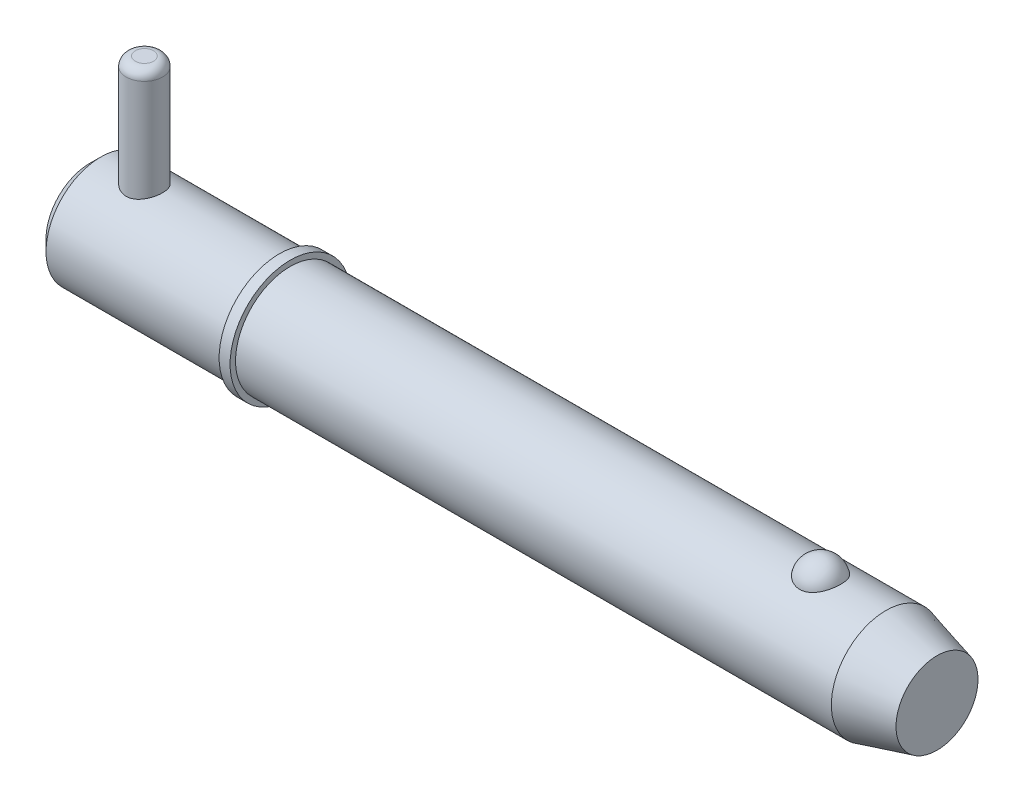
ISO-10303-21;
HEADER;
FILE_DESCRIPTION(('STEP AP214'),'2;1');
FILE_NAME('part.step','',(''),(''),'','','');
FILE_SCHEMA(('AUTOMOTIVE_DESIGN { 1 0 10303 214 1 1 1 1 }'));
ENDSEC;
DATA;
#1=APPLICATION_CONTEXT('core data for automotive mechanical design processes');
#2=APPLICATION_PROTOCOL_DEFINITION('international standard','automotive_design',2000,#1);
#3=PRODUCT_CONTEXT('',#1,'mechanical');
#4=PRODUCT('Part','Part','',(#3));
#5=PRODUCT_RELATED_PRODUCT_CATEGORY('part','',(#4));
#6=PRODUCT_DEFINITION_FORMATION('','',#4);
#7=PRODUCT_DEFINITION_CONTEXT('part definition',#1,'design');
#8=PRODUCT_DEFINITION('design','',#6,#7);
#9=PRODUCT_DEFINITION_SHAPE('','',#8);
#10=(LENGTH_UNIT() NAMED_UNIT(*) SI_UNIT(.MILLI.,.METRE.));
#11=(NAMED_UNIT(*) PLANE_ANGLE_UNIT() SI_UNIT($,.RADIAN.));
#12=(NAMED_UNIT(*) SI_UNIT($,.STERADIAN.) SOLID_ANGLE_UNIT());
#13=UNCERTAINTY_MEASURE_WITH_UNIT(LENGTH_MEASURE(1.E-05),#10,'distance_accuracy_value','');
#14=(GEOMETRIC_REPRESENTATION_CONTEXT(3) GLOBAL_UNCERTAINTY_ASSIGNED_CONTEXT((#13)) GLOBAL_UNIT_ASSIGNED_CONTEXT((#10,
#11,#12)) REPRESENTATION_CONTEXT('',''));
#15=CARTESIAN_POINT('',(0.,0.,0.));
#16=DIRECTION('',(0.,0.,1.));
#17=DIRECTION('',(1.,0.,0.));
#18=AXIS2_PLACEMENT_3D('',#15,#16,#17);
#19=CARTESIAN_POINT('',(9.52500000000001,28.575,0.));
#20=DIRECTION('',(0.,-1.,0.));
#21=DIRECTION('',(0.,0.,-1.));
#22=AXIS2_PLACEMENT_3D('',#19,#20,#21);
#23=CYLINDRICAL_SURFACE('',#22,3.175);
#24=CARTESIAN_POINT('',(9.52500000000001,-7.93750000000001,0.));
#25=DIRECTION('',(0.,1.,0.));
#26=DIRECTION('',(0.,0.,1.));
#27=AXIS2_PLACEMENT_3D('',#24,#25,#26);
#28=CIRCLE('',#27,3.175);
#29=CARTESIAN_POINT('',(9.52500000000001,-7.93750000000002,-3.175));
#30=VERTEX_POINT('',#29);
#31=EDGE_CURVE('P0_E25',#30,#30,#28,.T.);
#32=CARTESIAN_POINT('',(9.52500000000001,26.9875,0.));
#33=DIRECTION('',(0.,1.,0.));
#34=DIRECTION('',(0.,0.,1.));
#35=AXIS2_PLACEMENT_3D('',#32,#33,#34);
#36=CIRCLE('',#35,3.175);
#37=CARTESIAN_POINT('',(9.52500000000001,26.9875,-3.175));
#38=VERTEX_POINT('',#37);
#39=EDGE_CURVE('P0_E29',#38,#38,#36,.F.);
#40=CARTESIAN_POINT('',(9.52500000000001,-7.93750000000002,-3.175));
#41=CARTESIAN_POINT('',(9.52500000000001,-7.57369791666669,-3.175));
#42=CARTESIAN_POINT('',(9.52500000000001,-7.20989583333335,-3.175));
#43=CARTESIAN_POINT('',(9.52500000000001,-6.48229166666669,-3.175));
#44=CARTESIAN_POINT('',(9.52500000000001,-6.11848958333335,-3.175));
#45=CARTESIAN_POINT('',(9.52500000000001,-5.39088541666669,-3.175));
#46=CARTESIAN_POINT('',(9.52500000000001,-5.02708333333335,-3.175));
#47=CARTESIAN_POINT('',(9.52500000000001,-4.29947916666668,-3.175));
#48=CARTESIAN_POINT('',(9.52500000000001,-3.93567708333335,-3.175));
#49=CARTESIAN_POINT('',(9.52500000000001,-3.20807291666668,-3.175));
#50=CARTESIAN_POINT('',(9.52500000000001,-2.84427083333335,-3.175));
#51=CARTESIAN_POINT('',(9.52500000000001,-2.11666666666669,-3.175));
#52=CARTESIAN_POINT('',(9.52500000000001,-1.75286458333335,-3.175));
#53=CARTESIAN_POINT('',(9.52500000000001,-1.02526041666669,-3.175));
#54=CARTESIAN_POINT('',(9.52500000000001,-0.661458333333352,-3.175));
#55=CARTESIAN_POINT('',(9.52500000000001,0.0661458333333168,-3.175));
#56=CARTESIAN_POINT('',(9.52500000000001,0.429947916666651,-3.175));
#57=CARTESIAN_POINT('',(9.52500000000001,1.15755208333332,-3.175));
#58=CARTESIAN_POINT('',(9.52500000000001,1.52135416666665,-3.175));
#59=CARTESIAN_POINT('',(9.52500000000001,2.24895833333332,-3.175));
#60=CARTESIAN_POINT('',(9.52500000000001,2.61276041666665,-3.175));
#61=CARTESIAN_POINT('',(9.52500000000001,3.34036458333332,-3.175));
#62=CARTESIAN_POINT('',(9.52500000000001,3.70416666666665,-3.175));
#63=CARTESIAN_POINT('',(9.52500000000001,4.43177083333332,-3.175));
#64=CARTESIAN_POINT('',(9.52500000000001,4.79557291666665,-3.175));
#65=CARTESIAN_POINT('',(9.52500000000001,5.52317708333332,-3.175));
#66=CARTESIAN_POINT('',(9.52500000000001,5.88697916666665,-3.175));
#67=CARTESIAN_POINT('',(9.52500000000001,6.61458333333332,-3.175));
#68=CARTESIAN_POINT('',(9.52500000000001,6.97838541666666,-3.175));
#69=CARTESIAN_POINT('',(9.52500000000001,7.70598958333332,-3.175));
#70=CARTESIAN_POINT('',(9.52500000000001,8.06979166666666,-3.175));
#71=CARTESIAN_POINT('',(9.52500000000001,8.79739583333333,-3.175));
#72=CARTESIAN_POINT('',(9.52500000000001,9.16119791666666,-3.175));
#73=CARTESIAN_POINT('',(9.52500000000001,9.88880208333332,-3.175));
#74=CARTESIAN_POINT('',(9.52500000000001,10.2526041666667,-3.175));
#75=CARTESIAN_POINT('',(9.52500000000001,10.9802083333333,-3.175));
#76=CARTESIAN_POINT('',(9.52500000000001,11.3440104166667,-3.175));
#77=CARTESIAN_POINT('',(9.52500000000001,12.0716145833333,-3.175));
#78=CARTESIAN_POINT('',(9.52500000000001,12.4354166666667,-3.175));
#79=CARTESIAN_POINT('',(9.52500000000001,13.1630208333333,-3.175));
#80=CARTESIAN_POINT('',(9.52500000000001,13.5268229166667,-3.175));
#81=CARTESIAN_POINT('',(9.52500000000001,14.2544270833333,-3.175));
#82=CARTESIAN_POINT('',(9.52500000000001,14.6182291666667,-3.175));
#83=CARTESIAN_POINT('',(9.52500000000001,15.3458333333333,-3.175));
#84=CARTESIAN_POINT('',(9.52500000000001,15.7096354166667,-3.175));
#85=CARTESIAN_POINT('',(9.52500000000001,16.4372395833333,-3.175));
#86=CARTESIAN_POINT('',(9.52500000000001,16.8010416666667,-3.175));
#87=CARTESIAN_POINT('',(9.52500000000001,17.5286458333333,-3.175));
#88=CARTESIAN_POINT('',(9.52500000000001,17.8924479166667,-3.175));
#89=CARTESIAN_POINT('',(9.52500000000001,18.6200520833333,-3.175));
#90=CARTESIAN_POINT('',(9.52500000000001,18.9838541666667,-3.175));
#91=CARTESIAN_POINT('',(9.52500000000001,19.7114583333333,-3.175));
#92=CARTESIAN_POINT('',(9.52500000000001,20.0752604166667,-3.175));
#93=CARTESIAN_POINT('',(9.52500000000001,20.8028645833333,-3.175));
#94=CARTESIAN_POINT('',(9.52500000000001,21.1666666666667,-3.175));
#95=CARTESIAN_POINT('',(9.52500000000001,21.8942708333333,-3.175));
#96=CARTESIAN_POINT('',(9.52500000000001,22.2580729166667,-3.175));
#97=CARTESIAN_POINT('',(9.52500000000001,22.9856770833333,-3.175));
#98=CARTESIAN_POINT('',(9.52500000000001,23.3494791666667,-3.175));
#99=CARTESIAN_POINT('',(9.52500000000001,24.0770833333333,-3.175));
#100=CARTESIAN_POINT('',(9.52500000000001,24.4408854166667,-3.175));
#101=CARTESIAN_POINT('',(9.52500000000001,25.1684895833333,-3.175));
#102=CARTESIAN_POINT('',(9.52500000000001,25.5322916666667,-3.175));
#103=CARTESIAN_POINT('',(9.52500000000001,26.2598958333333,-3.175));
#104=CARTESIAN_POINT('',(9.52500000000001,26.6236979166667,-3.175));
#105=CARTESIAN_POINT('',(9.52500000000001,26.9875,-3.175));
#106=B_SPLINE_CURVE_WITH_KNOTS('',3,(#40,#41,#42,#43,#44,#45,#46,#47,#48,#49,#50,#51,#52,#53,
#54,#55,#56,#57,#58,#59,#60,#61,#62,#63,#64,#65,#66,#67,#68,#69,#70,#71,#72,#73,#74,#75,#76,#77,
#78,#79,#80,#81,#82,#83,#84,#85,#86,#87,#88,#89,#90,#91,#92,#93,#94,#95,#96,#97,#98,#99,#100,
#101,#102,#103,#104,#105),.UNSPECIFIED.,.F.,.F.,(4,2,2,2,2,2,2,2,2,2,2,2,2,2,2,2,2,2,2,2,2,2,2,
2,2,2,2,2,2,2,2,2,4),(0.,1.09140625,2.1828125,3.27421875,4.365625,5.45703125,6.5484375,
7.63984375,8.73125000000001,9.82265625,10.9140625,12.00546875,13.096875,14.18828125,15.2796875,
16.37109375,17.4625,18.55390625,19.6453125,20.73671875,21.828125,22.91953125,24.0109375,
25.10234375,26.19375,27.28515625,28.3765625,29.46796875,30.559375,31.65078125,32.7421875,
33.83359375,34.925),.UNSPECIFIED.);
#107=EDGE_CURVE('P0_BSEAM14',#30,#38,#106,.T.);
#108=ORIENTED_EDGE('',*,*,#31,.T.);
#109=ORIENTED_EDGE('',*,*,#39,.T.);
#110=ORIENTED_EDGE('',*,*,#107,.T.);
#111=ORIENTED_EDGE('',*,*,#107,.F.);
#112=EDGE_LOOP('',(#108,#110,#109,#111));
#113=FACE_BOUND('',#112,.T.);
#114=ADVANCED_FACE('P0_F14',(#113),#23,.T.);
#115=CARTESIAN_POINT('',(9.52500000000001,28.575,0.));
#116=DIRECTION('',(0.,1.,0.));
#117=DIRECTION('',(0.,0.,1.));
#118=AXIS2_PLACEMENT_3D('',#115,#116,#117);
#119=PLANE('',#118);
#120=CARTESIAN_POINT('',(9.52500000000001,28.575,0.));
#121=DIRECTION('',(0.,1.,0.));
#122=DIRECTION('',(0.,0.,1.));
#123=AXIS2_PLACEMENT_3D('',#120,#121,#122);
#124=CIRCLE('',#123,1.5875);
#125=CARTESIAN_POINT('',(9.52500000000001,28.575,1.5875));
#126=VERTEX_POINT('',#125);
#127=EDGE_CURVE('P0_E10',#126,#126,#124,.T.);
#128=ORIENTED_EDGE('',*,*,#127,.T.);
#129=EDGE_LOOP('',(#128));
#130=FACE_BOUND('',#129,.T.);
#131=ADVANCED_FACE('P0_F46',(#130),#119,.T.);
#132=CARTESIAN_POINT('',(9.52500000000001,-9.525,0.));
#133=DIRECTION('',(0.,1.,0.));
#134=DIRECTION('',(0.,0.,1.));
#135=AXIS2_PLACEMENT_3D('',#132,#133,#134);
#136=PLANE('',#135);
#137=CARTESIAN_POINT('',(9.52500000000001,-9.525,0.));
#138=DIRECTION('',(0.,1.,0.));
#139=DIRECTION('',(0.,0.,1.));
#140=AXIS2_PLACEMENT_3D('',#137,#138,#139);
#141=CIRCLE('',#140,1.5875);
#142=CARTESIAN_POINT('',(9.52500000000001,-9.525,1.5875));
#143=VERTEX_POINT('',#142);
#144=EDGE_CURVE('P0_E21',#143,#143,#141,.F.);
#145=ORIENTED_EDGE('',*,*,#144,.T.);
#146=EDGE_LOOP('',(#145));
#147=FACE_BOUND('',#146,.T.);
#148=ADVANCED_FACE('P0_F43',(#147),#136,.F.);
#149=CARTESIAN_POINT('',(9.52500000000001,-7.9375,0.));
#150=DIRECTION('',(0.,1.,0.));
#151=DIRECTION('',(0.,0.,1.));
#152=AXIS2_PLACEMENT_3D('',#149,#150,#151);
#153=DEGENERATE_TOROIDAL_SURFACE('',#152,1.5875,1.5875,.T.);
#154=ORIENTED_EDGE('',*,*,#144,.F.);
#155=EDGE_LOOP('',(#154));
#156=FACE_BOUND('',#155,.T.);
#157=ORIENTED_EDGE('',*,*,#31,.F.);
#158=EDGE_LOOP('',(#157));
#159=FACE_BOUND('',#158,.T.);
#160=ADVANCED_FACE('P0_F38',(#156,#159),#153,.T.);
#161=CARTESIAN_POINT('',(9.52500000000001,26.9875,0.));
#162=DIRECTION('',(0.,1.,0.));
#163=DIRECTION('',(0.,0.,1.));
#164=AXIS2_PLACEMENT_3D('',#161,#162,#163);
#165=DEGENERATE_TOROIDAL_SURFACE('',#164,1.5875,1.5875,.T.);
#166=ORIENTED_EDGE('',*,*,#39,.F.);
#167=EDGE_LOOP('',(#166));
#168=FACE_BOUND('',#167,.T.);
#169=ORIENTED_EDGE('',*,*,#127,.F.);
#170=EDGE_LOOP('',(#169));
#171=FACE_BOUND('',#170,.T.);
#172=ADVANCED_FACE('P0_F16',(#168,#171),#165,.T.);
#173=CLOSED_SHELL('',(#114,#131,#148,#160,#172));
#174=MANIFOLD_SOLID_BREP('P0_B1',#173);
#175=CARTESIAN_POINT('',(0.,0.,0.));
#176=DIRECTION('',(1.,0.,0.));
#177=DIRECTION('',(0.,0.,-1.));
#178=AXIS2_PLACEMENT_3D('',#175,#176,#177);
#179=CYLINDRICAL_SURFACE('',#178,9.525);
#180=CARTESIAN_POINT('',(138.743054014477,0.,0.));
#181=DIRECTION('',(1.,0.,0.));
#182=DIRECTION('',(0.,0.,-1.));
#183=AXIS2_PLACEMENT_3D('',#180,#181,#182);
#184=CIRCLE('',#183,9.525);
#185=CARTESIAN_POINT('',(138.743054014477,0.,-9.525));
#186=VERTEX_POINT('',#185);
#187=EDGE_CURVE('P1_E81',#186,#186,#184,.T.);
#188=ORIENTED_EDGE('',*,*,#187,.F.);
#189=EDGE_LOOP('',(#188));
#190=FACE_BOUND('',#189,.T.);
#191=CARTESIAN_POINT('',(34.93,0.,0.));
#192=DIRECTION('',(1.,0.,0.));
#193=DIRECTION('',(0.,0.,-1.));
#194=AXIS2_PLACEMENT_3D('',#191,#192,#193);
#195=CIRCLE('',#194,9.525);
#196=CARTESIAN_POINT('',(34.93,0.,-9.525));
#197=VERTEX_POINT('',#196);
#198=EDGE_CURVE('P1_E85',#197,#197,#195,.T.);
#199=ORIENTED_EDGE('',*,*,#198,.T.);
#200=EDGE_LOOP('',(#199));
#201=FACE_BOUND('',#200,.T.);
#202=CARTESIAN_POINT('',(127.345757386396,8.80405803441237,3.63513233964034));
#203=CARTESIAN_POINT('',(127.251676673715,8.80405953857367,3.63513053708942));
#204=CARTESIAN_POINT('',(127.157561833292,8.80561325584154,3.63137461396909));
#205=CARTESIAN_POINT('',(126.970012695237,8.81177748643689,3.61638665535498));
#206=CARTESIAN_POINT('',(126.876578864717,8.81638992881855,3.60514990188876));
#207=CARTESIAN_POINT('',(126.597945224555,8.8346711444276,3.56024627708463));
#208=CARTESIAN_POINT('',(126.414691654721,8.85278327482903,3.51538626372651));
#209=CARTESIAN_POINT('',(126.059509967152,8.89871214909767,3.39742145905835));
#210=CARTESIAN_POINT('',(125.887553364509,8.92650327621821,3.32439116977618));
#211=CARTESIAN_POINT('',(125.558707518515,8.98874819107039,3.15220244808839));
#212=CARTESIAN_POINT('',(125.401811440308,9.02319893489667,3.05305594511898));
#213=CARTESIAN_POINT('',(125.102214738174,9.09629186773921,2.82797815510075));
#214=CARTESIAN_POINT('',(124.960060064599,9.13502685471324,2.70135138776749));
#215=CARTESIAN_POINT('',(124.698299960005,9.2118657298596,2.42641932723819));
#216=CARTESIAN_POINT('',(124.578701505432,9.2499694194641,2.27810735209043));
#217=CARTESIAN_POINT('',(124.359645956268,9.32341082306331,1.95652290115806));
#218=CARTESIAN_POINT('',(124.261317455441,9.35855090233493,1.78243511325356));
#219=CARTESIAN_POINT('',(124.093819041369,9.42045142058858,1.41937246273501));
#220=CARTESIAN_POINT('',(124.024651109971,9.44721128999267,1.23039658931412));
#221=CARTESIAN_POINT('',(123.916199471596,9.48990641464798,0.840370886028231));
#222=CARTESIAN_POINT('',(123.877288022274,9.50570658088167,0.639202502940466));
#223=CARTESIAN_POINT('',(123.831555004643,9.52433146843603,0.232664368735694));
#224=CARTESIAN_POINT('',(123.824732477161,9.52715657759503,0.0272947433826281));
#225=CARTESIAN_POINT('',(123.843255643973,9.51956918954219,-0.380478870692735));
#226=CARTESIAN_POINT('',(123.868405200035,9.50923740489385,-0.582893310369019));
#227=CARTESIAN_POINT('',(123.95002537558,9.47651897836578,-0.980293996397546));
#228=CARTESIAN_POINT('',(124.006496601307,9.45413210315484,-1.17528009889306));
#229=CARTESIAN_POINT('',(124.149719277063,9.39954044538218,-1.55263697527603));
#230=CARTESIAN_POINT('',(124.236512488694,9.36732213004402,-1.73498993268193));
#231=CARTESIAN_POINT('',(124.438610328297,9.29640700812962,-2.08177763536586));
#232=CARTESIAN_POINT('',(124.553917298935,9.25770966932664,-2.24621090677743));
#233=CARTESIAN_POINT('',(124.811264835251,9.17775604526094,-2.55338333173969));
#234=CARTESIAN_POINT('',(124.953434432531,9.13648808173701,-2.69601150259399));
#235=CARTESIAN_POINT('',(125.26089985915,9.05620497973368,-2.95451229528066));
#236=CARTESIAN_POINT('',(125.426193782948,9.01718965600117,-3.07038711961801));
#237=CARTESIAN_POINT('',(125.772052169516,8.94680019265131,-3.26976836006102));
#238=CARTESIAN_POINT('',(125.952227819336,8.91528408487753,-3.353897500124));
#239=CARTESIAN_POINT('',(126.325651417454,8.86272514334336,-3.49043503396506));
#240=CARTESIAN_POINT('',(126.518894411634,8.84167836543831,-3.54285537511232));
#241=CARTESIAN_POINT('',(126.902503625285,8.81348056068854,-3.61241306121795));
#242=CARTESIAN_POINT('',(127.092525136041,8.80568348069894,-3.63119339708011));
#243=CARTESIAN_POINT('',(127.473190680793,8.80289410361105,-3.63795342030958));
#244=CARTESIAN_POINT('',(127.663834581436,8.80789922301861,-3.62593932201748));
#245=CARTESIAN_POINT('',(128.034007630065,8.82974915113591,-3.57238430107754));
#246=CARTESIAN_POINT('',(128.213697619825,8.84621463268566,-3.53178890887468));
#247=CARTESIAN_POINT('',(128.563422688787,8.88875330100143,-3.42331083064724));
#248=CARTESIAN_POINT('',(128.733456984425,8.91482726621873,-3.35542593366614));
#249=CARTESIAN_POINT('',(129.063237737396,8.97448239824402,-3.19248225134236));
#250=CARTESIAN_POINT('',(129.222680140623,9.00821446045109,-3.09686474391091));
#251=CARTESIAN_POINT('',(129.523513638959,9.07935398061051,-2.88162736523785));
#252=CARTESIAN_POINT('',(129.664900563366,9.11676228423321,-2.76200196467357));
#253=CARTESIAN_POINT('',(129.93331931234,9.19347419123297,-2.49516285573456));
#254=CARTESIAN_POINT('',(130.059275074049,9.23277872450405,-2.34686614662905));
#255=CARTESIAN_POINT('',(130.285522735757,9.3073761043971,-2.0309368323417));
#256=CARTESIAN_POINT('',(130.38581004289,9.34266823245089,-1.86330077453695));
#257=CARTESIAN_POINT('',(130.561514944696,9.40674710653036,-1.50744893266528));
#258=CARTESIAN_POINT('',(130.636041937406,9.43529176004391,-1.31874876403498));
#259=CARTESIAN_POINT('',(130.75416505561,9.48144132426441,-0.93063102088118));
#260=CARTESIAN_POINT('',(130.797760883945,9.49904612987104,-0.731213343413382));
#261=CARTESIAN_POINT('',(130.853158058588,9.5215314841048,-0.32714729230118));
#262=CARTESIAN_POINT('',(130.864935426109,9.52640243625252,-0.122495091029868));
#263=CARTESIAN_POINT('',(130.856382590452,9.5228957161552,0.286018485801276));
#264=CARTESIAN_POINT('',(130.83605305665,9.5145183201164,0.489879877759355));
#265=CARTESIAN_POINT('',(130.763884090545,9.48544083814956,0.889994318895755));
#266=CARTESIAN_POINT('',(130.712199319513,9.46480124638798,1.08627971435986));
#267=CARTESIAN_POINT('',(130.578491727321,9.4133389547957,1.46682086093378));
#268=CARTESIAN_POINT('',(130.496466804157,9.38251554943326,1.65107577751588));
#269=CARTESIAN_POINT('',(130.30319292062,9.31365636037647,2.00346348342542));
#270=CARTESIAN_POINT('',(130.191783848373,9.27558138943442,2.17150083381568));
#271=CARTESIAN_POINT('',(129.942294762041,9.19638714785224,2.48563115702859));
#272=CARTESIAN_POINT('',(129.804216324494,9.15526805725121,2.63172542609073));
#273=CARTESIAN_POINT('',(129.504843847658,9.07465393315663,2.89750997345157));
#274=CARTESIAN_POINT('',(129.343610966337,9.03515496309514,3.01726776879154));
#275=CARTESIAN_POINT('',(129.001613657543,8.96227564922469,3.22732920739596));
#276=CARTESIAN_POINT('',(128.820841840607,8.92889763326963,3.31762165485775));
#277=CARTESIAN_POINT('',(128.451445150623,8.8734538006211,3.46314419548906));
#278=CARTESIAN_POINT('',(128.26332371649,8.85102983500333,3.51950082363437));
#279=CARTESIAN_POINT('',(127.97578699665,8.8266696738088,3.57993683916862));
#280=CARTESIAN_POINT('',(127.879133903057,8.82009725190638,3.59606217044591));
#281=CARTESIAN_POINT('',(127.684677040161,8.81020897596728,3.62022512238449));
#282=CARTESIAN_POINT('',(127.58687410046,8.80689090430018,3.62826825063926));
#283=CARTESIAN_POINT('',(127.441224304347,8.80445615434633,3.63416760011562));
#284=CARTESIAN_POINT('',(127.393495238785,8.80405727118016,3.63513325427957));
#285=CARTESIAN_POINT('',(127.345757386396,8.80405803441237,3.63513233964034));
#286=B_SPLINE_CURVE_WITH_KNOTS('',3,(#202,#203,#204,#205,#206,#207,#208,#209,#210,#211,#212,
#213,#214,#215,#216,#217,#218,#219,#220,#221,#222,#223,#224,#225,#226,#227,#228,#229,#230,#231,
#232,#233,#234,#235,#236,#237,#238,#239,#240,#241,#242,#243,#244,#245,#246,#247,#248,#249,#250,
#251,#252,#253,#254,#255,#256,#257,#258,#259,#260,#261,#262,#263,#264,#265,#266,#267,#268,#269,
#270,#271,#272,#273,#274,#275,#276,#277,#278,#279,#280,#281,#282,#283,#284,#285),.UNSPECIFIED.,
.T.,.F.,(4,2,2,2,2,2,2,2,2,2,2,2,2,2,2,2,2,2,2,2,2,2,2,2,2,2,2,2,2,2,2,2,2,2,2,2,2,2,2,2,2,4),
(0.,0.282202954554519,0.564584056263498,1.13017050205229,1.69427128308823,2.25811483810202,
2.83836627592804,3.41879688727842,4.02497117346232,4.63118665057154,5.24474754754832,
5.85829010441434,6.46808687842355,7.07789545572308,7.68854723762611,8.29924920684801,
8.91296283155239,9.52662591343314,10.1275338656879,10.7282152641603,11.2986646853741,
11.868998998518,12.4213015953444,12.973648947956,13.5380053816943,14.1024919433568,
14.695298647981,15.2882113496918,15.8999469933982,16.5116885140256,17.1238909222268,
17.7360805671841,18.3452748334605,18.9545113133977,19.567138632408,20.179729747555,
20.7907316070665,21.4019653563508,21.9915938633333,22.2859053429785,22.5800161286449,
22.7232098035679),.UNSPECIFIED.);
#287=CARTESIAN_POINT('',(127.345757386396,8.80405803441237,3.63513233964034));
#288=VERTEX_POINT('',#287);
#289=EDGE_CURVE('P1_E35',#288,#288,#286,.T.);
#290=ORIENTED_EDGE('',*,*,#289,.T.);
#291=EDGE_LOOP('',(#290));
#292=FACE_BOUND('',#291,.T.);
#293=ADVANCED_FACE('P1_F13',(#190,#201,#292),#179,.T.);
#294=CARTESIAN_POINT('',(0.,0.,0.));
#295=DIRECTION('',(-1.,0.,0.));
#296=DIRECTION('',(0.,0.,1.));
#297=AXIS2_PLACEMENT_3D('',#294,#295,#296);
#298=PLANE('',#297);
#299=CARTESIAN_POINT('',(0.,0.,0.));
#300=DIRECTION('',(1.,0.,0.));
#301=DIRECTION('',(0.,0.,-1.));
#302=AXIS2_PLACEMENT_3D('',#299,#300,#301);
#303=CIRCLE('',#302,7.62);
#304=CARTESIAN_POINT('',(0.,0.,-7.62));
#305=VERTEX_POINT('',#304);
#306=EDGE_CURVE('P1_E9',#305,#305,#303,.T.);
#307=ORIENTED_EDGE('',*,*,#306,.F.);
#308=EDGE_LOOP('',(#307));
#309=FACE_BOUND('',#308,.T.);
#310=ADVANCED_FACE('P1_F15',(#309),#298,.T.);
#311=CARTESIAN_POINT('',(1.90499999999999,0.,0.));
#312=DIRECTION('',(1.,0.,0.));
#313=DIRECTION('',(0.,0.,-1.));
#314=AXIS2_PLACEMENT_3D('',#311,#312,#313);
#315=CONICAL_SURFACE('',#314,9.525,0.785398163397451);
#316=ORIENTED_EDGE('',*,*,#306,.T.);
#317=EDGE_LOOP('',(#316));
#318=FACE_BOUND('',#317,.T.);
#319=CARTESIAN_POINT('',(1.90499999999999,0.,0.));
#320=DIRECTION('',(1.,0.,0.));
#321=DIRECTION('',(0.,0.,-1.));
#322=AXIS2_PLACEMENT_3D('',#319,#320,#321);
#323=CIRCLE('',#322,9.525);
#324=CARTESIAN_POINT('',(1.90499999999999,0.,-9.525));
#325=VERTEX_POINT('',#324);
#326=EDGE_CURVE('P1_E26',#325,#325,#323,.T.);
#327=ORIENTED_EDGE('',*,*,#326,.F.);
#328=EDGE_LOOP('',(#327));
#329=FACE_BOUND('',#328,.T.);
#330=ADVANCED_FACE('P1_F77',(#318,#329),#315,.T.);
#331=CARTESIAN_POINT('',(0.,0.,0.));
#332=DIRECTION('',(1.,0.,0.));
#333=DIRECTION('',(0.,0.,-1.));
#334=AXIS2_PLACEMENT_3D('',#331,#332,#333);
#335=CYLINDRICAL_SURFACE('',#334,9.525);
#336=CARTESIAN_POINT('',(9.525,-8.98025612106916,3.175));
#337=CARTESIAN_POINT('',(9.35206354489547,-8.98025555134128,3.17500081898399));
#338=CARTESIAN_POINT('',(9.17913201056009,-8.98530617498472,3.16082293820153));
#339=CARTESIAN_POINT('',(8.83839221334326,-9.00485797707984,3.10467734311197));
#340=CARTESIAN_POINT('',(8.67058479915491,-9.0193607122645,3.06270505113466));
#341=CARTESIAN_POINT('',(8.34508461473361,-9.05599546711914,2.95260866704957));
#342=CARTESIAN_POINT('',(8.18737272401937,-9.07811252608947,2.88453582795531));
#343=CARTESIAN_POINT('',(7.88555684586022,-9.12746212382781,2.72434567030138));
#344=CARTESIAN_POINT('',(7.74145587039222,-9.1546957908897,2.63222304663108));
#345=CARTESIAN_POINT('',(7.46531411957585,-9.21240503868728,2.42268738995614));
#346=CARTESIAN_POINT('',(7.33388351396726,-9.24296141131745,2.30449228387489));
#347=CARTESIAN_POINT('',(7.09229340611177,-9.30319020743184,2.0478358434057));
#348=CARTESIAN_POINT('',(6.98213731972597,-9.33286248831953,1.90937126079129));
#349=CARTESIAN_POINT('',(6.78345450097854,-9.38891527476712,1.61164431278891));
#350=CARTESIAN_POINT('',(6.69556709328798,-9.41518969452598,1.45193356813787));
#351=CARTESIAN_POINT('',(6.54814671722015,-9.46053437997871,1.11896913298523));
#352=CARTESIAN_POINT('',(6.48860610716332,-9.47960658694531,0.945719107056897));
#353=CARTESIAN_POINT('',(6.40163866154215,-9.50782564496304,0.596991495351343));
#354=CARTESIAN_POINT('',(6.373166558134,-9.5172947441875,0.421801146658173));
#355=CARTESIAN_POINT('',(6.3458207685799,-9.52638456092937,0.068890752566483));
#356=CARTESIAN_POINT('',(6.34693945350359,-9.52600781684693,-0.108828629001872));
#357=CARTESIAN_POINT('',(6.37808050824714,-9.51566675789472,-0.454353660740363));
#358=CARTESIAN_POINT('',(6.4069675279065,-9.50607905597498,-0.622274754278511));
#359=CARTESIAN_POINT('',(6.490947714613,-9.47886621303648,-0.950732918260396));
#360=CARTESIAN_POINT('',(6.54604265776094,-9.46124052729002,-1.11126948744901));
#361=CARTESIAN_POINT('',(6.68153768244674,-9.41945253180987,-1.42288410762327));
#362=CARTESIAN_POINT('',(6.76226085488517,-9.3952073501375,-1.57381010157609));
#363=CARTESIAN_POINT('',(6.94645456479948,-9.34270397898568,-1.86030973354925));
#364=CARTESIAN_POINT('',(7.04993142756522,-9.31444467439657,-1.99587908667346));
#365=CARTESIAN_POINT('',(7.28241619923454,-9.25532159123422,-2.2545702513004));
#366=CARTESIAN_POINT('',(7.4123967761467,-9.22439783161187,-2.37680549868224));
#367=CARTESIAN_POINT('',(7.69127470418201,-9.1645528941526,-2.5980302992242));
#368=CARTESIAN_POINT('',(7.84017496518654,-9.13563202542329,-2.6970162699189));
#369=CARTESIAN_POINT('',(8.15547526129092,-9.08273917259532,-2.87016016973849));
#370=CARTESIAN_POINT('',(8.32209451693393,-9.05884361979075,-2.94394402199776));
#371=CARTESIAN_POINT('',(8.66638917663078,-9.01959241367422,-3.06210713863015));
#372=CARTESIAN_POINT('',(8.84405991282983,-9.00423318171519,-3.10649872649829));
#373=CARTESIAN_POINT('',(9.19682677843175,-8.98460345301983,-3.16281207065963));
#374=CARTESIAN_POINT('',(9.37167742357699,-8.9798639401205,-3.17610837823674));
#375=CARTESIAN_POINT('',(9.72113927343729,-8.9806993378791,-3.17374726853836));
#376=CARTESIAN_POINT('',(9.89575051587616,-8.98627237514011,-3.15809511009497));
#377=CARTESIAN_POINT('',(10.2335233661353,-9.00663737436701,-3.09951644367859));
#378=CARTESIAN_POINT('',(10.3968722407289,-9.02110608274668,-3.05754530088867));
#379=CARTESIAN_POINT('',(10.7141759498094,-9.05727657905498,-2.94866651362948));
#380=CARTESIAN_POINT('',(10.8681291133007,-9.07897964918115,-2.88175444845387));
#381=CARTESIAN_POINT('',(11.1676828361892,-9.12802586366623,-2.72248103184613));
#382=CARTESIAN_POINT('',(11.3128635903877,-9.1555260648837,-2.62937980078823));
#383=CARTESIAN_POINT('',(11.5860387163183,-9.21276315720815,-2.42120937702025));
#384=CARTESIAN_POINT('',(11.7140280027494,-9.24250070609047,-2.30613370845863));
#385=CARTESIAN_POINT('',(11.9555513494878,-9.30259247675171,-2.05070616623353));
#386=CARTESIAN_POINT('',(12.0680936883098,-9.33290753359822,-1.90940458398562));
#387=CARTESIAN_POINT('',(12.267933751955,-9.3893275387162,-1.60917665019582));
#388=CARTESIAN_POINT('',(12.3552323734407,-9.41543263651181,-1.45025092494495));
#389=CARTESIAN_POINT('',(12.5013088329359,-9.46036988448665,-1.12007606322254));
#390=CARTESIAN_POINT('',(12.5602723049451,-9.47924920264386,-0.9489158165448));
#391=CARTESIAN_POINT('',(12.6483355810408,-9.50781089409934,-0.598355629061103));
#392=CARTESIAN_POINT('',(12.6774461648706,-9.5174965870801,-0.4189586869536));
#393=CARTESIAN_POINT('',(12.7040070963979,-9.52632915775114,-0.066088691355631));
#394=CARTESIAN_POINT('',(12.7028811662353,-9.52594996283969,0.107266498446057));
#395=CARTESIAN_POINT('',(12.6725130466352,-9.51586223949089,0.451202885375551));
#396=CARTESIAN_POINT('',(12.643273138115,-9.50615446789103,0.621784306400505));
#397=CARTESIAN_POINT('',(12.5584514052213,-9.47867404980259,0.952633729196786));
#398=CARTESIAN_POINT('',(12.5032953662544,-9.46103195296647,1.1130225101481));
#399=CARTESIAN_POINT('',(12.3686013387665,-9.41949985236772,1.42233126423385));
#400=CARTESIAN_POINT('',(12.2890589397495,-9.39560871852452,1.57124915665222));
#401=CARTESIAN_POINT('',(12.1044667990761,-9.34294133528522,1.85938800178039));
#402=CARTESIAN_POINT('',(11.9985831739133,-9.31401720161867,1.9980473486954));
#403=CARTESIAN_POINT('',(11.7657327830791,-9.25490239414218,2.25609475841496));
#404=CARTESIAN_POINT('',(11.6387592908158,-9.22471131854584,2.37547664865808));
#405=CARTESIAN_POINT('',(11.3613902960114,-9.16505913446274,2.59633024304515));
#406=CARTESIAN_POINT('',(11.2102725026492,-9.13567286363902,2.69691791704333));
#407=CARTESIAN_POINT('',(10.8923631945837,-9.08241113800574,2.87119803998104));
#408=CARTESIAN_POINT('',(10.7255757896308,-9.05853424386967,2.94489751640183));
#409=CARTESIAN_POINT('',(10.3887212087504,-9.02021736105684,3.06020415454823));
#410=CARTESIAN_POINT('',(10.219143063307,-9.00539959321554,3.10311136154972));
#411=CARTESIAN_POINT('',(9.87470703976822,-8.98542092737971,3.16050396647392));
#412=CARTESIAN_POINT('',(9.699851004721,-8.98025669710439,3.17499917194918));
#413=CARTESIAN_POINT('',(9.525,-8.98025612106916,3.175));
#414=B_SPLINE_CURVE_WITH_KNOTS('',3,(#336,#337,#338,#339,#340,#341,#342,#343,#344,#345,#346,
#347,#348,#349,#350,#351,#352,#353,#354,#355,#356,#357,#358,#359,#360,#361,#362,#363,#364,#365,
#366,#367,#368,#369,#370,#371,#372,#373,#374,#375,#376,#377,#378,#379,#380,#381,#382,#383,#384,
#385,#386,#387,#388,#389,#390,#391,#392,#393,#394,#395,#396,#397,#398,#399,#400,#401,#402,#403,
#404,#405,#406,#407,#408,#409,#410,#411,#412,#413),.UNSPECIFIED.,.T.,.F.,(4,2,2,2,2,2,2,2,2,2,2,
2,2,2,2,2,2,2,2,2,2,2,2,2,2,2,2,2,2,2,2,2,2,2,2,2,2,2,4),(0.,0.518161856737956,1.03640907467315,
1.55364379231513,2.07099270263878,2.60671746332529,3.14252816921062,3.69231882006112,
4.24196117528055,4.77247962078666,5.30286129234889,5.81244090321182,6.32205505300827,
6.83836754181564,7.3548237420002,7.89559553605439,8.43645060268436,8.98501631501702,
9.53335188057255,10.056948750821,10.5804505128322,11.0859695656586,11.5915782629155,
12.1132237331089,12.6350231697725,13.1819271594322,13.7288117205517,14.2720628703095,
14.815117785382,15.3326491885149,15.8501386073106,16.3594083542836,16.868770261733,
17.3969527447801,17.925304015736,18.4743376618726,19.023227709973,19.5473069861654,
20.0712053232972),.UNSPECIFIED.);
#415=CARTESIAN_POINT('',(9.525,-8.98025612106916,3.175));
#416=VERTEX_POINT('',#415);
#417=EDGE_CURVE('P1_E17',#416,#416,#414,.T.);
#418=ORIENTED_EDGE('',*,*,#417,.F.);
#419=EDGE_LOOP('',(#418));
#420=FACE_BOUND('',#419,.T.);
#421=CARTESIAN_POINT('',(9.525,8.98025612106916,3.175));
#422=CARTESIAN_POINT('',(9.69793645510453,8.98025555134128,3.17500081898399));
#423=CARTESIAN_POINT('',(9.87086798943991,8.98530617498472,3.16082293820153));
#424=CARTESIAN_POINT('',(10.2116077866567,9.00485797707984,3.10467734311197));
#425=CARTESIAN_POINT('',(10.3794152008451,9.0193607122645,3.06270505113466));
#426=CARTESIAN_POINT('',(10.7049153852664,9.05599546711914,2.95260866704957));
#427=CARTESIAN_POINT('',(10.8626272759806,9.07811252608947,2.88453582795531));
#428=CARTESIAN_POINT('',(11.1644431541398,9.12746212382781,2.72434567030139));
#429=CARTESIAN_POINT('',(11.3085441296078,9.15469579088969,2.63222304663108));
#430=CARTESIAN_POINT('',(11.5846858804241,9.21240503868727,2.42268738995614));
#431=CARTESIAN_POINT('',(11.7161164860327,9.24296141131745,2.30449228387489));
#432=CARTESIAN_POINT('',(11.9577065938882,9.30319020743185,2.0478358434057));
#433=CARTESIAN_POINT('',(12.067862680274,9.33286248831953,1.90937126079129));
#434=CARTESIAN_POINT('',(12.2665454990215,9.38891527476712,1.61164431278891));
#435=CARTESIAN_POINT('',(12.354432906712,9.41518969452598,1.45193356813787));
#436=CARTESIAN_POINT('',(12.5018532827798,9.46053437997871,1.11896913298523));
#437=CARTESIAN_POINT('',(12.5613938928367,9.47960658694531,0.945719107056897));
#438=CARTESIAN_POINT('',(12.6483613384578,9.50782564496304,0.596991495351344));
#439=CARTESIAN_POINT('',(12.676833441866,9.5172947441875,0.421801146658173));
#440=CARTESIAN_POINT('',(12.7041792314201,9.52638456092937,0.0688907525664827));
#441=CARTESIAN_POINT('',(12.7030605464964,9.52600781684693,-0.108828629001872));
#442=CARTESIAN_POINT('',(12.6719194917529,9.51566675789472,-0.454353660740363));
#443=CARTESIAN_POINT('',(12.6430324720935,9.50607905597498,-0.622274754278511));
#444=CARTESIAN_POINT('',(12.559052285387,9.47886621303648,-0.950732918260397));
#445=CARTESIAN_POINT('',(12.5039573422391,9.46124052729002,-1.11126948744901));
#446=CARTESIAN_POINT('',(12.3684623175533,9.41945253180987,-1.42288410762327));
#447=CARTESIAN_POINT('',(12.2877391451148,9.3952073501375,-1.57381010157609));
#448=CARTESIAN_POINT('',(12.1035454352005,9.34270397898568,-1.86030973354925));
#449=CARTESIAN_POINT('',(12.0000685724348,9.31444467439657,-1.99587908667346));
#450=CARTESIAN_POINT('',(11.7675838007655,9.25532159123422,-2.2545702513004));
#451=CARTESIAN_POINT('',(11.6376032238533,9.22439783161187,-2.37680549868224));
#452=CARTESIAN_POINT('',(11.358725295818,9.1645528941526,-2.5980302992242));
#453=CARTESIAN_POINT('',(11.2098250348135,9.13563202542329,-2.6970162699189));
#454=CARTESIAN_POINT('',(10.8945247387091,9.08273917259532,-2.87016016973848));
#455=CARTESIAN_POINT('',(10.7279054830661,9.05884361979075,-2.94394402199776));
#456=CARTESIAN_POINT('',(10.3836108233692,9.01959241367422,-3.06210713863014));
#457=CARTESIAN_POINT('',(10.2059400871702,9.00423318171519,-3.10649872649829));
#458=CARTESIAN_POINT('',(9.85317322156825,8.98460345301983,-3.16281207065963));
#459=CARTESIAN_POINT('',(9.67832257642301,8.9798639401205,-3.17610837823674));
#460=CARTESIAN_POINT('',(9.32886072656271,8.9806993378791,-3.17374726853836));
#461=CARTESIAN_POINT('',(9.15424948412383,8.98627237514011,-3.15809511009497));
#462=CARTESIAN_POINT('',(8.81647663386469,9.00663737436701,-3.09951644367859));
#463=CARTESIAN_POINT('',(8.65312775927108,9.02110608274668,-3.05754530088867));
#464=CARTESIAN_POINT('',(8.33582405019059,9.05727657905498,-2.94866651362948));
#465=CARTESIAN_POINT('',(8.18187088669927,9.07897964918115,-2.88175444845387));
#466=CARTESIAN_POINT('',(7.88231716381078,9.12802586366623,-2.72248103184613));
#467=CARTESIAN_POINT('',(7.73713640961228,9.1555260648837,-2.62937980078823));
#468=CARTESIAN_POINT('',(7.46396128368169,9.21276315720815,-2.42120937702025));
#469=CARTESIAN_POINT('',(7.33597199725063,9.24250070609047,-2.30613370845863));
#470=CARTESIAN_POINT('',(7.09444865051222,9.30259247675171,-2.05070616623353));
#471=CARTESIAN_POINT('',(6.98190631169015,9.33290753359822,-1.90940458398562));
#472=CARTESIAN_POINT('',(6.78206624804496,9.3893275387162,-1.60917665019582));
#473=CARTESIAN_POINT('',(6.6947676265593,9.41543263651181,-1.45025092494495));
#474=CARTESIAN_POINT('',(6.54869116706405,9.46036988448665,-1.12007606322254));
#475=CARTESIAN_POINT('',(6.48972769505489,9.47924920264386,-0.948915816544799));
#476=CARTESIAN_POINT('',(6.40166441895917,9.50781089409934,-0.598355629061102));
#477=CARTESIAN_POINT('',(6.3725538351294,9.5174965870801,-0.418958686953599));
#478=CARTESIAN_POINT('',(6.34599290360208,9.52632915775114,-0.0660886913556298));
#479=CARTESIAN_POINT('',(6.3471188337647,9.52594996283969,0.107266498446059));
#480=CARTESIAN_POINT('',(6.37748695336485,9.51586223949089,0.451202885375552));
#481=CARTESIAN_POINT('',(6.40672686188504,9.50615446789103,0.621784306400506));
#482=CARTESIAN_POINT('',(6.49154859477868,9.47867404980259,0.952633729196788));
#483=CARTESIAN_POINT('',(6.54670463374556,9.46103195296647,1.11302251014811));
#484=CARTESIAN_POINT('',(6.68139866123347,9.41949985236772,1.42233126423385));
#485=CARTESIAN_POINT('',(6.76094106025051,9.39560871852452,1.57124915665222));
#486=CARTESIAN_POINT('',(6.94553320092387,9.34294133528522,1.85938800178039));
#487=CARTESIAN_POINT('',(7.05141682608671,9.31401720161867,1.9980473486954));
#488=CARTESIAN_POINT('',(7.28426721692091,9.25490239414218,2.25609475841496));
#489=CARTESIAN_POINT('',(7.41124070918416,9.22471131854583,2.37547664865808));
#490=CARTESIAN_POINT('',(7.68860970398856,9.16505913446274,2.59633024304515));
#491=CARTESIAN_POINT('',(7.83972749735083,9.13567286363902,2.69691791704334));
#492=CARTESIAN_POINT('',(8.15763680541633,9.08241113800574,2.87119803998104));
#493=CARTESIAN_POINT('',(8.32442421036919,9.05853424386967,2.94489751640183));
#494=CARTESIAN_POINT('',(8.66127879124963,9.02021736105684,3.06020415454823));
#495=CARTESIAN_POINT('',(8.83085693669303,9.00539959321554,3.10311136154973));
#496=CARTESIAN_POINT('',(9.17529296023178,8.98542092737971,3.16050396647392));
#497=CARTESIAN_POINT('',(9.350148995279,8.98025669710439,3.17499917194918));
#498=CARTESIAN_POINT('',(9.525,8.98025612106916,3.175));
#499=B_SPLINE_CURVE_WITH_KNOTS('',3,(#421,#422,#423,#424,#425,#426,#427,#428,#429,#430,#431,
#432,#433,#434,#435,#436,#437,#438,#439,#440,#441,#442,#443,#444,#445,#446,#447,#448,#449,#450,
#451,#452,#453,#454,#455,#456,#457,#458,#459,#460,#461,#462,#463,#464,#465,#466,#467,#468,#469,
#470,#471,#472,#473,#474,#475,#476,#477,#478,#479,#480,#481,#482,#483,#484,#485,#486,#487,#488,
#489,#490,#491,#492,#493,#494,#495,#496,#497,#498),.UNSPECIFIED.,.T.,.F.,(4,2,2,2,2,2,2,2,2,2,2,
2,2,2,2,2,2,2,2,2,2,2,2,2,2,2,2,2,2,2,2,2,2,2,2,2,2,2,4),(0.,0.518161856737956,1.03640907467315,
1.55364379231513,2.07099270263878,2.60671746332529,3.14252816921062,3.69231882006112,
4.24196117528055,4.77247962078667,5.30286129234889,5.81244090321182,6.32205505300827,
6.83836754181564,7.3548237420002,7.89559553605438,8.43645060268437,8.98501631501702,
9.53335188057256,10.056948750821,10.5804505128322,11.0859695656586,11.5915782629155,
12.1132237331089,12.6350231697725,13.1819271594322,13.7288117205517,14.2720628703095,
14.815117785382,15.3326491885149,15.8501386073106,16.3594083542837,16.868770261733,
17.3969527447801,17.9253040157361,18.4743376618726,19.023227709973,19.5473069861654,
20.0712053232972),.UNSPECIFIED.);
#500=CARTESIAN_POINT('',(9.525,8.98025612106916,3.175));
#501=VERTEX_POINT('',#500);
#502=EDGE_CURVE('P1_E43',#501,#501,#499,.T.);
#503=ORIENTED_EDGE('',*,*,#502,.F.);
#504=EDGE_LOOP('',(#503));
#505=FACE_BOUND('',#504,.T.);
#506=ORIENTED_EDGE('',*,*,#326,.T.);
#507=EDGE_LOOP('',(#506));
#508=FACE_BOUND('',#507,.T.);
#509=CARTESIAN_POINT('',(33.025,0.,0.));
#510=DIRECTION('',(1.,0.,0.));
#511=DIRECTION('',(0.,0.,-1.));
#512=AXIS2_PLACEMENT_3D('',#509,#510,#511);
#513=CIRCLE('',#512,9.525);
#514=CARTESIAN_POINT('',(33.025,0.,-9.525));
#515=VERTEX_POINT('',#514);
#516=EDGE_CURVE('P1_E31',#515,#515,#513,.T.);
#517=ORIENTED_EDGE('',*,*,#516,.F.);
#518=EDGE_LOOP('',(#517));
#519=FACE_BOUND('',#518,.T.);
#520=ADVANCED_FACE('P1_F103',(#420,#505,#508,#519),#335,.T.);
#521=CARTESIAN_POINT('',(33.025,9.525,0.));
#522=DIRECTION('',(-1.,0.,0.));
#523=DIRECTION('',(0.,0.,1.));
#524=AXIS2_PLACEMENT_3D('',#521,#522,#523);
#525=PLANE('',#524);
#526=ORIENTED_EDGE('',*,*,#516,.T.);
#527=EDGE_LOOP('',(#526));
#528=FACE_BOUND('',#527,.T.);
#529=CARTESIAN_POINT('',(33.025,0.,0.));
#530=DIRECTION('',(1.,0.,0.));
#531=DIRECTION('',(0.,0.,-1.));
#532=AXIS2_PLACEMENT_3D('',#529,#530,#531);
#533=CIRCLE('',#532,10.4775);
#534=CARTESIAN_POINT('',(33.025,0.,-10.4775));
#535=VERTEX_POINT('',#534);
#536=EDGE_CURVE('P1_E91',#535,#535,#533,.T.);
#537=ORIENTED_EDGE('',*,*,#536,.F.);
#538=EDGE_LOOP('',(#537));
#539=FACE_BOUND('',#538,.T.);
#540=ADVANCED_FACE('P1_F100',(#528,#539),#525,.T.);
#541=CARTESIAN_POINT('',(0.,0.,0.));
#542=DIRECTION('',(1.,0.,0.));
#543=DIRECTION('',(0.,0.,-1.));
#544=AXIS2_PLACEMENT_3D('',#541,#542,#543);
#545=CYLINDRICAL_SURFACE('',#544,10.4775);
#546=ORIENTED_EDGE('',*,*,#536,.T.);
#547=EDGE_LOOP('',(#546));
#548=FACE_BOUND('',#547,.T.);
#549=CARTESIAN_POINT('',(34.93,0.,0.));
#550=DIRECTION('',(1.,0.,0.));
#551=DIRECTION('',(0.,0.,-1.));
#552=AXIS2_PLACEMENT_3D('',#549,#550,#551);
#553=CIRCLE('',#552,10.4775);
#554=CARTESIAN_POINT('',(34.93,0.,-10.4775));
#555=VERTEX_POINT('',#554);
#556=EDGE_CURVE('P1_E88',#555,#555,#553,.T.);
#557=ORIENTED_EDGE('',*,*,#556,.F.);
#558=EDGE_LOOP('',(#557));
#559=FACE_BOUND('',#558,.T.);
#560=ADVANCED_FACE('P1_F68',(#548,#559),#545,.T.);
#561=CARTESIAN_POINT('',(34.93,10.4775,0.));
#562=DIRECTION('',(1.,0.,0.));
#563=DIRECTION('',(0.,0.,-1.));
#564=AXIS2_PLACEMENT_3D('',#561,#562,#563);
#565=PLANE('',#564);
#566=ORIENTED_EDGE('',*,*,#556,.T.);
#567=EDGE_LOOP('',(#566));
#568=FACE_BOUND('',#567,.T.);
#569=ORIENTED_EDGE('',*,*,#198,.F.);
#570=EDGE_LOOP('',(#569));
#571=FACE_BOUND('',#570,.T.);
#572=ADVANCED_FACE('P1_F62',(#568,#571),#565,.T.);
#573=CARTESIAN_POINT('',(147.63,0.,0.));
#574=DIRECTION('',(-1.,0.,0.));
#575=DIRECTION('',(0.,0.,1.));
#576=AXIS2_PLACEMENT_3D('',#573,#574,#575);
#577=CONICAL_SURFACE('',#576,7.14375000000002,0.26179938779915);
#578=ORIENTED_EDGE('',*,*,#187,.T.);
#579=EDGE_LOOP('',(#578));
#580=FACE_BOUND('',#579,.T.);
#581=CARTESIAN_POINT('',(147.63,0.,0.));
#582=DIRECTION('',(1.,0.,0.));
#583=DIRECTION('',(0.,0.,-1.));
#584=AXIS2_PLACEMENT_3D('',#581,#582,#583);
#585=CIRCLE('',#584,7.14375000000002);
#586=CARTESIAN_POINT('',(147.63,0.,-7.14375000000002));
#587=VERTEX_POINT('',#586);
#588=EDGE_CURVE('P1_E42',#587,#587,#585,.T.);
#589=ORIENTED_EDGE('',*,*,#588,.F.);
#590=EDGE_LOOP('',(#589));
#591=FACE_BOUND('',#590,.T.);
#592=ADVANCED_FACE('P1_F59',(#580,#591),#577,.T.);
#593=CARTESIAN_POINT('',(147.63,7.14375000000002,0.));
#594=DIRECTION('',(1.,0.,0.));
#595=DIRECTION('',(0.,0.,-1.));
#596=AXIS2_PLACEMENT_3D('',#593,#594,#595);
#597=PLANE('',#596);
#598=ORIENTED_EDGE('',*,*,#588,.T.);
#599=EDGE_LOOP('',(#598));
#600=FACE_BOUND('',#599,.T.);
#601=ADVANCED_FACE('P1_F55',(#600),#597,.T.);
#602=CARTESIAN_POINT('',(127.345757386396,8.5725,0.));
#603=DIRECTION('',(-1.,0.,0.));
#604=DIRECTION('',(0.,1.,0.));
#605=AXIS2_PLACEMENT_3D('',#602,#603,#604);
#606=SPHERICAL_SURFACE('',#605,3.6425);
#607=ORIENTED_EDGE('',*,*,#289,.F.);
#608=EDGE_LOOP('',(#607));
#609=FACE_BOUND('',#608,.T.);
#610=ADVANCED_FACE('P1_F50',(#609),#606,.T.);
#611=CARTESIAN_POINT('',(9.525,-10.4775,0.));
#612=DIRECTION('',(0.,1.,0.));
#613=DIRECTION('',(0.,0.,1.));
#614=AXIS2_PLACEMENT_3D('',#611,#612,#613);
#615=CYLINDRICAL_SURFACE('',#614,3.175);
#616=ORIENTED_EDGE('',*,*,#417,.T.);
#617=EDGE_LOOP('',(#616));
#618=FACE_BOUND('',#617,.T.);
#619=ORIENTED_EDGE('',*,*,#502,.T.);
#620=EDGE_LOOP('',(#619));
#621=FACE_BOUND('',#620,.T.);
#622=ADVANCED_FACE('P1_F54',(#618,#621),#615,.F.);
#623=CLOSED_SHELL('',(#293,#310,#330,#520,#540,#560,#572,#592,#601,#610,#622));
#624=MANIFOLD_SOLID_BREP('P1_B1',#623);
#625=ADVANCED_BREP_SHAPE_REPRESENTATION('',(#18,#174,#624),#14);
#626=SHAPE_DEFINITION_REPRESENTATION(#9,#625);
ENDSEC;
END-ISO-10303-21;
